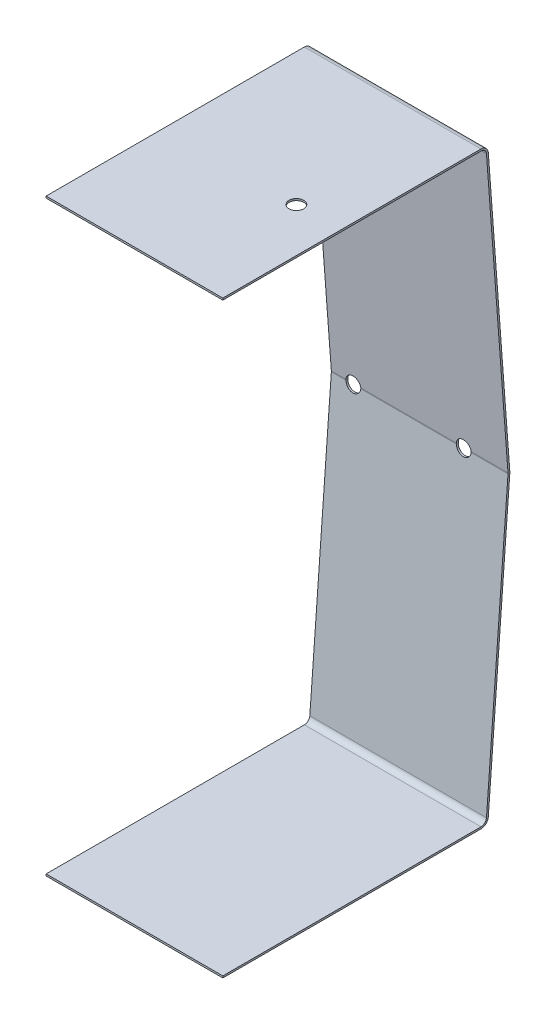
from build123d import *

# Parameters (mm, degrees)
SKETCH1_W          = 152.4
SKETCH1_H          = 508
EXTRUDE1_DEPTH     = 228.6
EXTRUDE2_DEPTH     = 152.4
FILLET1_R          = 6.35
SHELL1_T           = -1.5875
SKETCH3_R          = 6.35
CUT_EXTRUDE1_DEPTH = 363.827961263
CUT_EXTRUDE2_REACH = 572.256
SKETCH4_R          = 6.35


with BuildPart() as part:
    # Sketch1 → Extrude1 (new body)
    with BuildSketch(Plane.XY):
        Rectangle(SKETCH1_W, SKETCH1_H)
    extrude(amount=-EXTRUDE1_DEPTH)

    # Sketch2 → Extrude2 (add)
    with BuildSketch(Plane(origin=(76.2, 0, 0), x_dir=(0, 0, -1), z_dir=(1, 0, 0))):
        Polygon((228.6, 254), (247.65, 0), (228.6, -254), align=None)
    extrude(amount=-EXTRUDE2_DEPTH)

    # Fillet1
    fillet1_edges = [part.edges().sort_by_distance(p)[0] for p in [
        (0, 254, -228.6),
        (0, -254, -228.6),
        (0, 0, -247.65),
    ]]
    fillet(fillet1_edges, radius=FILLET1_R)

    # Shell1
    shell1_openings = [part.faces().sort_by_distance(p)[0] for p in [
        (0, 0, 0),
        (76.2, 0, -119.113011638),
        (-76.2, 0, -119.113011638),
    ]]
    offset(amount=SHELL1_T, openings=shell1_openings, kind=Kind.INTERSECTION)

    # Sketch3 → Cut-Extrude1 (cut, through all)
    with BuildSketch(Plane.XY):
        with Locations(Location((-57.15, 0, 0), (0, 0, 356.784451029))):
            Circle(SKETCH3_R)
        with Locations(Location((38.1, 0, 0), (0, 0, 356.784451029))):
            Circle(SKETCH3_R)
    extrude(amount=-CUT_EXTRUDE1_DEPTH, mode=Mode.SUBTRACT)

    # Sketch4 → Cut-Extrude2 (cut, up to next)
    with BuildSketch(Plane(origin=(0, 254, 0), x_dir=(1, 0, 0), z_dir=(0, 1, 0)), mode=Mode.PRIVATE) as cut_extrude2_sk1:
        with Locations(Location((38.1, 101.6, 0), (0, 0, 270))):
            Circle(SKETCH4_R)
    cut_extrude2_tool1 = extrude(cut_extrude2_sk1.sketch, amount=-CUT_EXTRUDE2_REACH, mode=Mode.PRIVATE) & part.part
    add(cut_extrude2_tool1.solids().sort_by_distance((38.1, 254, -101.6))[0], mode=Mode.SUBTRACT)


solid = part.part
